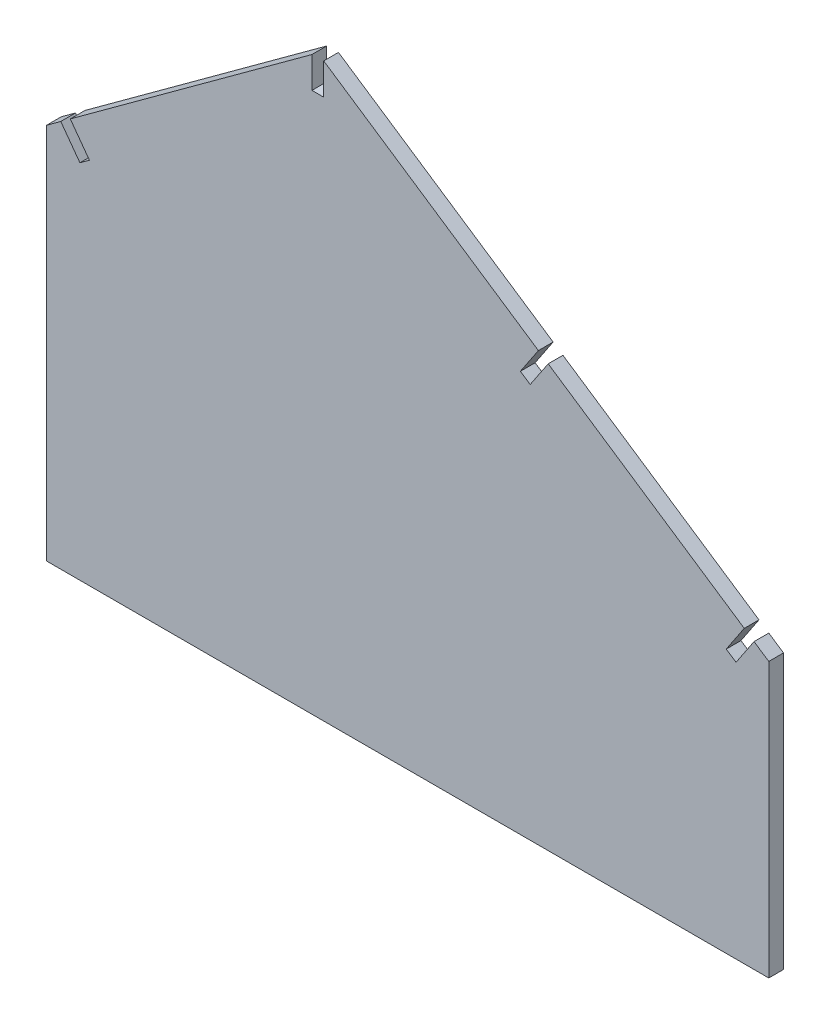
from build123d import *

# Parameters (mm, degrees)
EXTRUSION1_DEPTH = 5


with BuildPart() as part:
    # Esquisse1 → Extrusion1 (new body)
    with BuildSketch(Plane.XY):
        Polygon((-92.03825919, -72.886182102), (152.96174081, -72.886182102), (152.96174081, 20.113817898), (147.973857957, 23.44863793), (141.860021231, 14.304186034), (138.534765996, 16.527399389), (144.648602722, 25.671851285), (78.143498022, 70.136118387), (72.029661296, 60.991666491), (68.704406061, 63.214879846), (74.818242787, 72.359331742), (2, 121.044463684), (2, 110.381632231), (-2, 110.381632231), (-2, 120.91989632), (-83.964727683, 61.014503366), (-77.473973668, 52.133618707), (-80.703386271, 49.77334452), (-87.194140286, 58.654229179), (-92.03825919, 55.113817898), align=None)
    extrude(amount=EXTRUSION1_DEPTH)


solid = part.part
